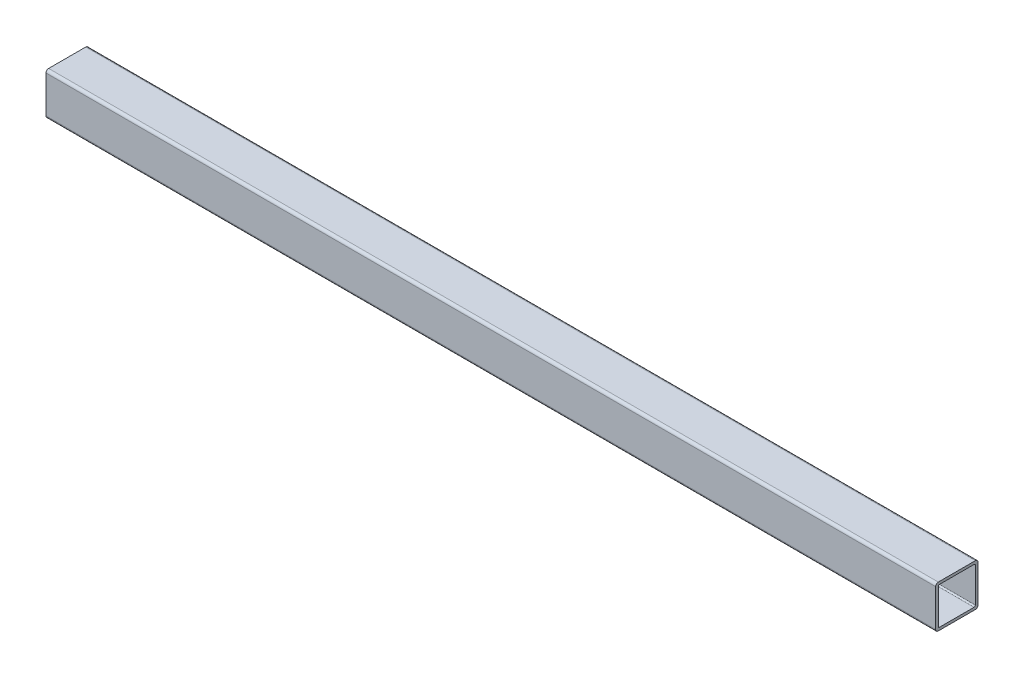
ISO-10303-21;
HEADER;
FILE_DESCRIPTION(('STEP AP214'),'2;1');
FILE_NAME('part.step','',(''),(''),'','','');
FILE_SCHEMA(('AUTOMOTIVE_DESIGN { 1 0 10303 214 1 1 1 1 }'));
ENDSEC;
DATA;
#1=APPLICATION_CONTEXT('core data for automotive mechanical design processes');
#2=APPLICATION_PROTOCOL_DEFINITION('international standard','automotive_design',2000,#1);
#3=PRODUCT_CONTEXT('',#1,'mechanical');
#4=PRODUCT('Part','Part','',(#3));
#5=PRODUCT_RELATED_PRODUCT_CATEGORY('part','',(#4));
#6=PRODUCT_DEFINITION_FORMATION('','',#4);
#7=PRODUCT_DEFINITION_CONTEXT('part definition',#1,'design');
#8=PRODUCT_DEFINITION('design','',#6,#7);
#9=PRODUCT_DEFINITION_SHAPE('','',#8);
#10=(LENGTH_UNIT() NAMED_UNIT(*) SI_UNIT(.MILLI.,.METRE.));
#11=(NAMED_UNIT(*) PLANE_ANGLE_UNIT() SI_UNIT($,.RADIAN.));
#12=(NAMED_UNIT(*) SI_UNIT($,.STERADIAN.) SOLID_ANGLE_UNIT());
#13=UNCERTAINTY_MEASURE_WITH_UNIT(LENGTH_MEASURE(1.E-05),#10,'distance_accuracy_value','');
#14=(GEOMETRIC_REPRESENTATION_CONTEXT(3) GLOBAL_UNCERTAINTY_ASSIGNED_CONTEXT((#13)) GLOBAL_UNIT_ASSIGNED_CONTEXT((#10,
#11,#12)) REPRESENTATION_CONTEXT('',''));
#15=CARTESIAN_POINT('',(0.,0.,0.));
#16=DIRECTION('',(0.,0.,1.));
#17=DIRECTION('',(1.,0.,0.));
#18=AXIS2_PLACEMENT_3D('',#15,#16,#17);
#19=CARTESIAN_POINT('',(533.4,-22.225,22.225));
#20=DIRECTION('',(1.,0.,0.));
#21=DIRECTION('',(0.,0.,-1.));
#22=AXIS2_PLACEMENT_3D('',#19,#20,#21);
#23=PLANE('',#22);
#24=CARTESIAN_POINT('',(533.4,-22.225,22.225));
#25=DIRECTION('',(1.,0.,0.));
#26=DIRECTION('',(0.,0.,-1.));
#27=AXIS2_PLACEMENT_3D('',#24,#25,#26);
#28=CIRCLE('',#27,3.175);
#29=CARTESIAN_POINT('',(533.4,-22.225,25.4));
#30=VERTEX_POINT('',#29);
#31=CARTESIAN_POINT('',(533.4,-25.4,22.225));
#32=VERTEX_POINT('',#31);
#33=EDGE_CURVE('E211',#30,#32,#28,.T.);
#34=ORIENTED_EDGE('',*,*,#33,.T.);
#35=DIRECTION('',(0.,0.,-1.));
#36=VECTOR('',#35,1.);
#37=CARTESIAN_POINT('',(533.4,-25.4,22.225));
#38=LINE('',#37,#36);
#39=CARTESIAN_POINT('',(533.4,-25.4,-22.225));
#40=VERTEX_POINT('',#39);
#41=EDGE_CURVE('E214',#32,#40,#38,.T.);
#42=ORIENTED_EDGE('',*,*,#41,.T.);
#43=CARTESIAN_POINT('',(533.4,-22.225,-22.225));
#44=DIRECTION('',(1.,0.,0.));
#45=DIRECTION('',(0.,0.,-1.));
#46=AXIS2_PLACEMENT_3D('',#43,#44,#45);
#47=CIRCLE('',#46,3.175);
#48=CARTESIAN_POINT('',(533.4,-22.225,-25.4));
#49=VERTEX_POINT('',#48);
#50=EDGE_CURVE('E217',#40,#49,#47,.T.);
#51=ORIENTED_EDGE('',*,*,#50,.T.);
#52=DIRECTION('',(0.,1.,0.));
#53=VECTOR('',#52,1.);
#54=CARTESIAN_POINT('',(533.4,22.225,-25.4));
#55=LINE('',#54,#53);
#56=CARTESIAN_POINT('',(533.4,22.225,-25.4));
#57=VERTEX_POINT('',#56);
#58=EDGE_CURVE('E219',#49,#57,#55,.T.);
#59=ORIENTED_EDGE('',*,*,#58,.T.);
#60=CARTESIAN_POINT('',(533.4,22.225,-22.225));
#61=DIRECTION('',(1.,0.,0.));
#62=DIRECTION('',(0.,0.,1.));
#63=AXIS2_PLACEMENT_3D('',#60,#61,#62);
#64=CIRCLE('',#63,3.175);
#65=CARTESIAN_POINT('',(533.4,25.4,-22.225));
#66=VERTEX_POINT('',#65);
#67=EDGE_CURVE('E221',#57,#66,#64,.T.);
#68=ORIENTED_EDGE('',*,*,#67,.T.);
#69=DIRECTION('',(0.,0.,1.));
#70=VECTOR('',#69,1.);
#71=CARTESIAN_POINT('',(533.4,25.4,22.225));
#72=LINE('',#71,#70);
#73=CARTESIAN_POINT('',(533.4,25.4,22.225));
#74=VERTEX_POINT('',#73);
#75=EDGE_CURVE('E223',#66,#74,#72,.T.);
#76=ORIENTED_EDGE('',*,*,#75,.T.);
#77=CARTESIAN_POINT('',(533.4,22.225,22.225));
#78=DIRECTION('',(1.,0.,0.));
#79=DIRECTION('',(0.,0.,-1.));
#80=AXIS2_PLACEMENT_3D('',#77,#78,#79);
#81=CIRCLE('',#80,3.175);
#82=CARTESIAN_POINT('',(533.4,22.225,25.4));
#83=VERTEX_POINT('',#82);
#84=EDGE_CURVE('E225',#74,#83,#81,.T.);
#85=ORIENTED_EDGE('',*,*,#84,.T.);
#86=DIRECTION('',(0.,-1.,0.));
#87=VECTOR('',#86,1.);
#88=CARTESIAN_POINT('',(533.4,22.225,25.4));
#89=LINE('',#88,#87);
#90=EDGE_CURVE('E227',#83,#30,#89,.T.);
#91=ORIENTED_EDGE('',*,*,#90,.T.);
#92=EDGE_LOOP('',(#34,#42,#51,#59,#68,#76,#85,#91));
#93=FACE_BOUND('',#92,.T.);
#94=DIRECTION('',(0.,-1.,0.));
#95=VECTOR('',#94,1.);
#96=CARTESIAN_POINT('',(533.4,20.6375,22.225));
#97=LINE('',#96,#95);
#98=CARTESIAN_POINT('',(533.4,20.6375,22.225));
#99=VERTEX_POINT('',#98);
#100=CARTESIAN_POINT('',(533.4,-20.6375,22.225));
#101=VERTEX_POINT('',#100);
#102=EDGE_CURVE('E154',#99,#101,#97,.T.);
#103=ORIENTED_EDGE('',*,*,#102,.F.);
#104=CARTESIAN_POINT('',(533.4,20.6375,20.6375));
#105=DIRECTION('',(1.,0.,0.));
#106=DIRECTION('',(0.,0.,-1.));
#107=AXIS2_PLACEMENT_3D('',#104,#105,#106);
#108=CIRCLE('',#107,1.5875);
#109=CARTESIAN_POINT('',(533.4,22.225,20.6375));
#110=VERTEX_POINT('',#109);
#111=EDGE_CURVE('E146',#110,#99,#108,.T.);
#112=ORIENTED_EDGE('',*,*,#111,.F.);
#113=DIRECTION('',(0.,0.,1.));
#114=VECTOR('',#113,1.);
#115=CARTESIAN_POINT('',(533.4,22.225,20.6375));
#116=LINE('',#115,#114);
#117=CARTESIAN_POINT('',(533.4,22.225,-20.6375));
#118=VERTEX_POINT('',#117);
#119=EDGE_CURVE('E179',#118,#110,#116,.T.);
#120=ORIENTED_EDGE('',*,*,#119,.F.);
#121=CARTESIAN_POINT('',(533.4,20.6375,-20.6375));
#122=DIRECTION('',(1.,0.,0.));
#123=DIRECTION('',(0.,0.,1.));
#124=AXIS2_PLACEMENT_3D('',#121,#122,#123);
#125=CIRCLE('',#124,1.5875);
#126=CARTESIAN_POINT('',(533.4,20.6375,-22.225));
#127=VERTEX_POINT('',#126);
#128=EDGE_CURVE('E177',#127,#118,#125,.T.);
#129=ORIENTED_EDGE('',*,*,#128,.F.);
#130=DIRECTION('',(0.,1.,0.));
#131=VECTOR('',#130,1.);
#132=CARTESIAN_POINT('',(533.4,20.6375,-22.225));
#133=LINE('',#132,#131);
#134=CARTESIAN_POINT('',(533.4,-20.6375,-22.225));
#135=VERTEX_POINT('',#134);
#136=EDGE_CURVE('E175',#135,#127,#133,.T.);
#137=ORIENTED_EDGE('',*,*,#136,.F.);
#138=CARTESIAN_POINT('',(533.4,-20.6375,-20.6375));
#139=DIRECTION('',(1.,0.,0.));
#140=DIRECTION('',(0.,0.,-1.));
#141=AXIS2_PLACEMENT_3D('',#138,#139,#140);
#142=CIRCLE('',#141,1.5875);
#143=CARTESIAN_POINT('',(533.4,-22.225,-20.6375));
#144=VERTEX_POINT('',#143);
#145=EDGE_CURVE('E173',#144,#135,#142,.T.);
#146=ORIENTED_EDGE('',*,*,#145,.F.);
#147=DIRECTION('',(0.,0.,-1.));
#148=VECTOR('',#147,1.);
#149=CARTESIAN_POINT('',(533.4,-22.225,20.6375));
#150=LINE('',#149,#148);
#151=CARTESIAN_POINT('',(533.4,-22.225,20.6375));
#152=VERTEX_POINT('',#151);
#153=EDGE_CURVE('E169',#152,#144,#150,.T.);
#154=ORIENTED_EDGE('',*,*,#153,.F.);
#155=CARTESIAN_POINT('',(533.4,-20.6375,20.6375));
#156=DIRECTION('',(1.,0.,0.));
#157=DIRECTION('',(0.,0.,-1.));
#158=AXIS2_PLACEMENT_3D('',#155,#156,#157);
#159=CIRCLE('',#158,1.5875);
#160=EDGE_CURVE('E167',#101,#152,#159,.T.);
#161=ORIENTED_EDGE('',*,*,#160,.F.);
#162=EDGE_LOOP('',(#103,#112,#120,#129,#137,#146,#154,#161));
#163=FACE_BOUND('',#162,.T.);
#164=ADVANCED_FACE('F33',(#93,#163),#23,.T.);
#165=CARTESIAN_POINT('',(-533.4,-22.225,22.225));
#166=DIRECTION('',(1.,0.,0.));
#167=DIRECTION('',(0.,0.,-1.));
#168=AXIS2_PLACEMENT_3D('',#165,#166,#167);
#169=PLANE('',#168);
#170=CARTESIAN_POINT('',(-533.4,-22.225,22.225));
#171=DIRECTION('',(1.,0.,0.));
#172=DIRECTION('',(0.,0.,-1.));
#173=AXIS2_PLACEMENT_3D('',#170,#171,#172);
#174=CIRCLE('',#173,3.175);
#175=CARTESIAN_POINT('',(-533.4,-22.225,25.4));
#176=VERTEX_POINT('',#175);
#177=CARTESIAN_POINT('',(-533.4,-25.4,22.225));
#178=VERTEX_POINT('',#177);
#179=EDGE_CURVE('E162',#176,#178,#174,.T.);
#180=ORIENTED_EDGE('',*,*,#179,.F.);
#181=DIRECTION('',(0.,-1.,0.));
#182=VECTOR('',#181,1.);
#183=CARTESIAN_POINT('',(-533.4,22.225,25.4));
#184=LINE('',#183,#182);
#185=CARTESIAN_POINT('',(-533.4,22.225,25.4));
#186=VERTEX_POINT('',#185);
#187=EDGE_CURVE('E215',#186,#176,#184,.T.);
#188=ORIENTED_EDGE('',*,*,#187,.F.);
#189=CARTESIAN_POINT('',(-533.4,22.225,22.225));
#190=DIRECTION('',(1.,0.,0.));
#191=DIRECTION('',(0.,0.,-1.));
#192=AXIS2_PLACEMENT_3D('',#189,#190,#191);
#193=CIRCLE('',#192,3.175);
#194=CARTESIAN_POINT('',(-533.4,25.4,22.225));
#195=VERTEX_POINT('',#194);
#196=EDGE_CURVE('E242',#195,#186,#193,.T.);
#197=ORIENTED_EDGE('',*,*,#196,.F.);
#198=DIRECTION('',(0.,0.,1.));
#199=VECTOR('',#198,1.);
#200=CARTESIAN_POINT('',(-533.4,25.4,22.225));
#201=LINE('',#200,#199);
#202=CARTESIAN_POINT('',(-533.4,25.4,-22.225));
#203=VERTEX_POINT('',#202);
#204=EDGE_CURVE('E240',#203,#195,#201,.T.);
#205=ORIENTED_EDGE('',*,*,#204,.F.);
#206=CARTESIAN_POINT('',(-533.4,22.225,-22.225));
#207=DIRECTION('',(1.,0.,0.));
#208=DIRECTION('',(0.,0.,1.));
#209=AXIS2_PLACEMENT_3D('',#206,#207,#208);
#210=CIRCLE('',#209,3.175);
#211=CARTESIAN_POINT('',(-533.4,22.225,-25.4));
#212=VERTEX_POINT('',#211);
#213=EDGE_CURVE('E238',#212,#203,#210,.T.);
#214=ORIENTED_EDGE('',*,*,#213,.F.);
#215=DIRECTION('',(0.,1.,0.));
#216=VECTOR('',#215,1.);
#217=CARTESIAN_POINT('',(-533.4,22.225,-25.4));
#218=LINE('',#217,#216);
#219=CARTESIAN_POINT('',(-533.4,-22.225,-25.4));
#220=VERTEX_POINT('',#219);
#221=EDGE_CURVE('E236',#220,#212,#218,.T.);
#222=ORIENTED_EDGE('',*,*,#221,.F.);
#223=CARTESIAN_POINT('',(-533.4,-22.225,-22.225));
#224=DIRECTION('',(1.,0.,0.));
#225=DIRECTION('',(0.,0.,-1.));
#226=AXIS2_PLACEMENT_3D('',#223,#224,#225);
#227=CIRCLE('',#226,3.175);
#228=CARTESIAN_POINT('',(-533.4,-25.4,-22.225));
#229=VERTEX_POINT('',#228);
#230=EDGE_CURVE('E234',#229,#220,#227,.T.);
#231=ORIENTED_EDGE('',*,*,#230,.F.);
#232=DIRECTION('',(0.,0.,-1.));
#233=VECTOR('',#232,1.);
#234=CARTESIAN_POINT('',(-533.4,-25.4,22.225));
#235=LINE('',#234,#233);
#236=EDGE_CURVE('E232',#178,#229,#235,.T.);
#237=ORIENTED_EDGE('',*,*,#236,.F.);
#238=EDGE_LOOP('',(#180,#188,#197,#205,#214,#222,#231,#237));
#239=FACE_BOUND('',#238,.T.);
#240=CARTESIAN_POINT('',(-533.4,20.6375,20.6375));
#241=DIRECTION('',(1.,0.,0.));
#242=DIRECTION('',(0.,0.,-1.));
#243=AXIS2_PLACEMENT_3D('',#240,#241,#242);
#244=CIRCLE('',#243,1.5875);
#245=CARTESIAN_POINT('',(-533.4,22.225,20.6375));
#246=VERTEX_POINT('',#245);
#247=CARTESIAN_POINT('',(-533.4,20.6375,22.225));
#248=VERTEX_POINT('',#247);
#249=EDGE_CURVE('E56',#246,#248,#244,.T.);
#250=ORIENTED_EDGE('',*,*,#249,.T.);
#251=DIRECTION('',(0.,-1.,0.));
#252=VECTOR('',#251,1.);
#253=CARTESIAN_POINT('',(-533.4,20.6375,22.225));
#254=LINE('',#253,#252);
#255=CARTESIAN_POINT('',(-533.4,-20.6375,22.225));
#256=VERTEX_POINT('',#255);
#257=EDGE_CURVE('E161',#248,#256,#254,.T.);
#258=ORIENTED_EDGE('',*,*,#257,.T.);
#259=CARTESIAN_POINT('',(-533.4,-20.6375,20.6375));
#260=DIRECTION('',(1.,0.,0.));
#261=DIRECTION('',(0.,0.,-1.));
#262=AXIS2_PLACEMENT_3D('',#259,#260,#261);
#263=CIRCLE('',#262,1.5875);
#264=CARTESIAN_POINT('',(-533.4,-22.225,20.6375));
#265=VERTEX_POINT('',#264);
#266=EDGE_CURVE('E183',#256,#265,#263,.T.);
#267=ORIENTED_EDGE('',*,*,#266,.T.);
#268=DIRECTION('',(0.,0.,-1.));
#269=VECTOR('',#268,1.);
#270=CARTESIAN_POINT('',(-533.4,-22.225,20.6375));
#271=LINE('',#270,#269);
#272=CARTESIAN_POINT('',(-533.4,-22.225,-20.6375));
#273=VERTEX_POINT('',#272);
#274=EDGE_CURVE('E186',#265,#273,#271,.T.);
#275=ORIENTED_EDGE('',*,*,#274,.T.);
#276=CARTESIAN_POINT('',(-533.4,-20.6375,-20.6375));
#277=DIRECTION('',(1.,0.,0.));
#278=DIRECTION('',(0.,0.,-1.));
#279=AXIS2_PLACEMENT_3D('',#276,#277,#278);
#280=CIRCLE('',#279,1.5875);
#281=CARTESIAN_POINT('',(-533.4,-20.6375,-22.225));
#282=VERTEX_POINT('',#281);
#283=EDGE_CURVE('E189',#273,#282,#280,.T.);
#284=ORIENTED_EDGE('',*,*,#283,.T.);
#285=DIRECTION('',(0.,1.,0.));
#286=VECTOR('',#285,1.);
#287=CARTESIAN_POINT('',(-533.4,20.6375,-22.225));
#288=LINE('',#287,#286);
#289=CARTESIAN_POINT('',(-533.4,20.6375,-22.225));
#290=VERTEX_POINT('',#289);
#291=EDGE_CURVE('E192',#282,#290,#288,.T.);
#292=ORIENTED_EDGE('',*,*,#291,.T.);
#293=CARTESIAN_POINT('',(-533.4,20.6375,-20.6375));
#294=DIRECTION('',(1.,0.,0.));
#295=DIRECTION('',(0.,0.,1.));
#296=AXIS2_PLACEMENT_3D('',#293,#294,#295);
#297=CIRCLE('',#296,1.5875);
#298=CARTESIAN_POINT('',(-533.4,22.225,-20.6375));
#299=VERTEX_POINT('',#298);
#300=EDGE_CURVE('E195',#290,#299,#297,.T.);
#301=ORIENTED_EDGE('',*,*,#300,.T.);
#302=DIRECTION('',(0.,0.,1.));
#303=VECTOR('',#302,1.);
#304=CARTESIAN_POINT('',(-533.4,22.225,20.6375));
#305=LINE('',#304,#303);
#306=EDGE_CURVE('E155',#299,#246,#305,.T.);
#307=ORIENTED_EDGE('',*,*,#306,.T.);
#308=EDGE_LOOP('',(#250,#258,#267,#275,#284,#292,#301,#307));
#309=FACE_BOUND('',#308,.T.);
#310=ADVANCED_FACE('F272',(#239,#309),#169,.F.);
#311=CARTESIAN_POINT('',(533.4,-22.225,22.225));
#312=DIRECTION('',(-1.,0.,0.));
#313=DIRECTION('',(0.,0.,1.));
#314=AXIS2_PLACEMENT_3D('',#311,#312,#313);
#315=CYLINDRICAL_SURFACE('',#314,3.175);
#316=ORIENTED_EDGE('',*,*,#179,.T.);
#317=DIRECTION('',(-1.,0.,0.));
#318=VECTOR('',#317,1.);
#319=CARTESIAN_POINT('',(533.4,-25.4,22.225));
#320=LINE('',#319,#318);
#321=EDGE_CURVE('E11',#32,#178,#320,.T.);
#322=ORIENTED_EDGE('',*,*,#321,.F.);
#323=ORIENTED_EDGE('',*,*,#33,.F.);
#324=DIRECTION('',(-1.,0.,0.));
#325=VECTOR('',#324,1.);
#326=CARTESIAN_POINT('',(533.4,-22.225,25.4));
#327=LINE('',#326,#325);
#328=EDGE_CURVE('E229',#30,#176,#327,.T.);
#329=ORIENTED_EDGE('',*,*,#328,.T.);
#330=EDGE_LOOP('',(#316,#322,#323,#329));
#331=FACE_BOUND('',#330,.T.);
#332=ADVANCED_FACE('F35',(#331),#315,.T.);
#333=CARTESIAN_POINT('',(533.4,-25.4,22.225));
#334=DIRECTION('',(0.,1.,0.));
#335=DIRECTION('',(0.,0.,1.));
#336=AXIS2_PLACEMENT_3D('',#333,#334,#335);
#337=PLANE('',#336);
#338=ORIENTED_EDGE('',*,*,#236,.T.);
#339=DIRECTION('',(-1.,0.,0.));
#340=VECTOR('',#339,1.);
#341=CARTESIAN_POINT('',(533.4,-25.4,-22.225));
#342=LINE('',#341,#340);
#343=EDGE_CURVE('E41',#40,#229,#342,.T.);
#344=ORIENTED_EDGE('',*,*,#343,.F.);
#345=ORIENTED_EDGE('',*,*,#41,.F.);
#346=ORIENTED_EDGE('',*,*,#321,.T.);
#347=EDGE_LOOP('',(#338,#344,#345,#346));
#348=FACE_BOUND('',#347,.T.);
#349=ADVANCED_FACE('F289',(#348),#337,.F.);
#350=CARTESIAN_POINT('',(533.4,-22.225,-22.225));
#351=DIRECTION('',(-1.,0.,0.));
#352=DIRECTION('',(0.,0.,1.));
#353=AXIS2_PLACEMENT_3D('',#350,#351,#352);
#354=CYLINDRICAL_SURFACE('',#353,3.175);
#355=ORIENTED_EDGE('',*,*,#230,.T.);
#356=DIRECTION('',(-1.,0.,0.));
#357=VECTOR('',#356,1.);
#358=CARTESIAN_POINT('',(533.4,-22.225,-25.4));
#359=LINE('',#358,#357);
#360=EDGE_CURVE('E259',#49,#220,#359,.T.);
#361=ORIENTED_EDGE('',*,*,#360,.F.);
#362=ORIENTED_EDGE('',*,*,#50,.F.);
#363=ORIENTED_EDGE('',*,*,#343,.T.);
#364=EDGE_LOOP('',(#355,#361,#362,#363));
#365=FACE_BOUND('',#364,.T.);
#366=ADVANCED_FACE('F266',(#365),#354,.T.);
#367=CARTESIAN_POINT('',(533.4,22.225,-25.4));
#368=DIRECTION('',(0.,0.,1.));
#369=DIRECTION('',(0.,-1.,0.));
#370=AXIS2_PLACEMENT_3D('',#367,#368,#369);
#371=PLANE('',#370);
#372=ORIENTED_EDGE('',*,*,#221,.T.);
#373=DIRECTION('',(-1.,0.,0.));
#374=VECTOR('',#373,1.);
#375=CARTESIAN_POINT('',(533.4,22.225,-25.4));
#376=LINE('',#375,#374);
#377=EDGE_CURVE('E256',#57,#212,#376,.T.);
#378=ORIENTED_EDGE('',*,*,#377,.F.);
#379=ORIENTED_EDGE('',*,*,#58,.F.);
#380=ORIENTED_EDGE('',*,*,#360,.T.);
#381=EDGE_LOOP('',(#372,#378,#379,#380));
#382=FACE_BOUND('',#381,.T.);
#383=ADVANCED_FACE('F278',(#382),#371,.F.);
#384=CARTESIAN_POINT('',(533.4,22.225,-22.225));
#385=DIRECTION('',(-1.,0.,0.));
#386=DIRECTION('',(0.,0.,1.));
#387=AXIS2_PLACEMENT_3D('',#384,#385,#386);
#388=CYLINDRICAL_SURFACE('',#387,3.175);
#389=ORIENTED_EDGE('',*,*,#213,.T.);
#390=DIRECTION('',(-1.,0.,0.));
#391=VECTOR('',#390,1.);
#392=CARTESIAN_POINT('',(533.4,25.4,-22.225));
#393=LINE('',#392,#391);
#394=EDGE_CURVE('E253',#66,#203,#393,.T.);
#395=ORIENTED_EDGE('',*,*,#394,.F.);
#396=ORIENTED_EDGE('',*,*,#67,.F.);
#397=ORIENTED_EDGE('',*,*,#377,.T.);
#398=EDGE_LOOP('',(#389,#395,#396,#397));
#399=FACE_BOUND('',#398,.T.);
#400=ADVANCED_FACE('F282',(#399),#388,.T.);
#401=CARTESIAN_POINT('',(533.4,25.4,22.225));
#402=DIRECTION('',(0.,-1.,0.));
#403=DIRECTION('',(0.,0.,-1.));
#404=AXIS2_PLACEMENT_3D('',#401,#402,#403);
#405=PLANE('',#404);
#406=ORIENTED_EDGE('',*,*,#204,.T.);
#407=DIRECTION('',(-1.,0.,0.));
#408=VECTOR('',#407,1.);
#409=CARTESIAN_POINT('',(533.4,25.4,22.225));
#410=LINE('',#409,#408);
#411=EDGE_CURVE('E250',#74,#195,#410,.T.);
#412=ORIENTED_EDGE('',*,*,#411,.F.);
#413=ORIENTED_EDGE('',*,*,#75,.F.);
#414=ORIENTED_EDGE('',*,*,#394,.T.);
#415=EDGE_LOOP('',(#406,#412,#413,#414));
#416=FACE_BOUND('',#415,.T.);
#417=ADVANCED_FACE('F302',(#416),#405,.F.);
#418=CARTESIAN_POINT('',(533.4,22.225,22.225));
#419=DIRECTION('',(-1.,0.,0.));
#420=DIRECTION('',(0.,0.,1.));
#421=AXIS2_PLACEMENT_3D('',#418,#419,#420);
#422=CYLINDRICAL_SURFACE('',#421,3.175);
#423=ORIENTED_EDGE('',*,*,#196,.T.);
#424=DIRECTION('',(-1.,0.,0.));
#425=VECTOR('',#424,1.);
#426=CARTESIAN_POINT('',(533.4,22.225,25.4));
#427=LINE('',#426,#425);
#428=EDGE_CURVE('E247',#83,#186,#427,.T.);
#429=ORIENTED_EDGE('',*,*,#428,.F.);
#430=ORIENTED_EDGE('',*,*,#84,.F.);
#431=ORIENTED_EDGE('',*,*,#411,.T.);
#432=EDGE_LOOP('',(#423,#429,#430,#431));
#433=FACE_BOUND('',#432,.T.);
#434=ADVANCED_FACE('F300',(#433),#422,.T.);
#435=CARTESIAN_POINT('',(533.4,22.225,25.4));
#436=DIRECTION('',(0.,0.,-1.));
#437=DIRECTION('',(0.,1.,0.));
#438=AXIS2_PLACEMENT_3D('',#435,#436,#437);
#439=PLANE('',#438);
#440=ORIENTED_EDGE('',*,*,#187,.T.);
#441=ORIENTED_EDGE('',*,*,#328,.F.);
#442=ORIENTED_EDGE('',*,*,#90,.F.);
#443=ORIENTED_EDGE('',*,*,#428,.T.);
#444=EDGE_LOOP('',(#440,#441,#442,#443));
#445=FACE_BOUND('',#444,.T.);
#446=ADVANCED_FACE('F295',(#445),#439,.F.);
#447=CARTESIAN_POINT('',(533.4,20.6375,20.6375));
#448=DIRECTION('',(-1.,0.,0.));
#449=DIRECTION('',(0.,0.,1.));
#450=AXIS2_PLACEMENT_3D('',#447,#448,#449);
#451=CYLINDRICAL_SURFACE('',#450,1.5875);
#452=ORIENTED_EDGE('',*,*,#249,.F.);
#453=DIRECTION('',(-1.,0.,0.));
#454=VECTOR('',#453,1.);
#455=CARTESIAN_POINT('',(533.4,22.225,20.6375));
#456=LINE('',#455,#454);
#457=EDGE_CURVE('E150',#110,#246,#456,.T.);
#458=ORIENTED_EDGE('',*,*,#457,.F.);
#459=ORIENTED_EDGE('',*,*,#111,.T.);
#460=DIRECTION('',(-1.,0.,0.));
#461=VECTOR('',#460,1.);
#462=CARTESIAN_POINT('',(533.4,20.6375,22.225));
#463=LINE('',#462,#461);
#464=EDGE_CURVE('E149',#99,#248,#463,.T.);
#465=ORIENTED_EDGE('',*,*,#464,.T.);
#466=EDGE_LOOP('',(#452,#458,#459,#465));
#467=FACE_BOUND('',#466,.T.);
#468=ADVANCED_FACE('F148',(#467),#451,.F.);
#469=CARTESIAN_POINT('',(533.4,20.6375,22.225));
#470=DIRECTION('',(0.,0.,-1.));
#471=DIRECTION('',(-1.,0.,0.));
#472=AXIS2_PLACEMENT_3D('',#469,#470,#471);
#473=PLANE('',#472);
#474=ORIENTED_EDGE('',*,*,#257,.F.);
#475=ORIENTED_EDGE('',*,*,#464,.F.);
#476=ORIENTED_EDGE('',*,*,#102,.T.);
#477=DIRECTION('',(-1.,0.,0.));
#478=VECTOR('',#477,1.);
#479=CARTESIAN_POINT('',(533.4,-20.6375,22.225));
#480=LINE('',#479,#478);
#481=EDGE_CURVE('E163',#101,#256,#480,.T.);
#482=ORIENTED_EDGE('',*,*,#481,.T.);
#483=EDGE_LOOP('',(#474,#475,#476,#482));
#484=FACE_BOUND('',#483,.T.);
#485=ADVANCED_FACE('F158',(#484),#473,.T.);
#486=CARTESIAN_POINT('',(533.4,-20.6375,20.6375));
#487=DIRECTION('',(-1.,0.,0.));
#488=DIRECTION('',(0.,0.,1.));
#489=AXIS2_PLACEMENT_3D('',#486,#487,#488);
#490=CYLINDRICAL_SURFACE('',#489,1.5875);
#491=ORIENTED_EDGE('',*,*,#266,.F.);
#492=ORIENTED_EDGE('',*,*,#481,.F.);
#493=ORIENTED_EDGE('',*,*,#160,.T.);
#494=DIRECTION('',(-1.,0.,0.));
#495=VECTOR('',#494,1.);
#496=CARTESIAN_POINT('',(533.4,-22.225,20.6375));
#497=LINE('',#496,#495);
#498=EDGE_CURVE('E208',#152,#265,#497,.T.);
#499=ORIENTED_EDGE('',*,*,#498,.T.);
#500=EDGE_LOOP('',(#491,#492,#493,#499));
#501=FACE_BOUND('',#500,.T.);
#502=ADVANCED_FACE('F327',(#501),#490,.F.);
#503=CARTESIAN_POINT('',(533.4,-22.225,20.6375));
#504=DIRECTION('',(0.,1.,0.));
#505=DIRECTION('',(0.,0.,1.));
#506=AXIS2_PLACEMENT_3D('',#503,#504,#505);
#507=PLANE('',#506);
#508=ORIENTED_EDGE('',*,*,#274,.F.);
#509=ORIENTED_EDGE('',*,*,#498,.F.);
#510=ORIENTED_EDGE('',*,*,#153,.T.);
#511=DIRECTION('',(-1.,0.,0.));
#512=VECTOR('',#511,1.);
#513=CARTESIAN_POINT('',(533.4,-22.225,-20.6375));
#514=LINE('',#513,#512);
#515=EDGE_CURVE('E206',#144,#273,#514,.T.);
#516=ORIENTED_EDGE('',*,*,#515,.T.);
#517=EDGE_LOOP('',(#508,#509,#510,#516));
#518=FACE_BOUND('',#517,.T.);
#519=ADVANCED_FACE('F331',(#518),#507,.T.);
#520=CARTESIAN_POINT('',(533.4,-20.6375,-20.6375));
#521=DIRECTION('',(-1.,0.,0.));
#522=DIRECTION('',(0.,0.,1.));
#523=AXIS2_PLACEMENT_3D('',#520,#521,#522);
#524=CYLINDRICAL_SURFACE('',#523,1.5875);
#525=ORIENTED_EDGE('',*,*,#283,.F.);
#526=ORIENTED_EDGE('',*,*,#515,.F.);
#527=ORIENTED_EDGE('',*,*,#145,.T.);
#528=DIRECTION('',(-1.,0.,0.));
#529=VECTOR('',#528,1.);
#530=CARTESIAN_POINT('',(533.4,-20.6375,-22.225));
#531=LINE('',#530,#529);
#532=EDGE_CURVE('E204',#135,#282,#531,.T.);
#533=ORIENTED_EDGE('',*,*,#532,.T.);
#534=EDGE_LOOP('',(#525,#526,#527,#533));
#535=FACE_BOUND('',#534,.T.);
#536=ADVANCED_FACE('F337',(#535),#524,.F.);
#537=CARTESIAN_POINT('',(533.4,20.6375,-22.225));
#538=DIRECTION('',(0.,0.,1.));
#539=DIRECTION('',(0.,-1.,0.));
#540=AXIS2_PLACEMENT_3D('',#537,#538,#539);
#541=PLANE('',#540);
#542=ORIENTED_EDGE('',*,*,#291,.F.);
#543=ORIENTED_EDGE('',*,*,#532,.F.);
#544=ORIENTED_EDGE('',*,*,#136,.T.);
#545=DIRECTION('',(-1.,0.,0.));
#546=VECTOR('',#545,1.);
#547=CARTESIAN_POINT('',(533.4,20.6375,-22.225));
#548=LINE('',#547,#546);
#549=EDGE_CURVE('E202',#127,#290,#548,.T.);
#550=ORIENTED_EDGE('',*,*,#549,.T.);
#551=EDGE_LOOP('',(#542,#543,#544,#550));
#552=FACE_BOUND('',#551,.T.);
#553=ADVANCED_FACE('F341',(#552),#541,.T.);
#554=CARTESIAN_POINT('',(533.4,20.6375,-20.6375));
#555=DIRECTION('',(-1.,0.,0.));
#556=DIRECTION('',(0.,0.,1.));
#557=AXIS2_PLACEMENT_3D('',#554,#555,#556);
#558=CYLINDRICAL_SURFACE('',#557,1.5875);
#559=ORIENTED_EDGE('',*,*,#300,.F.);
#560=ORIENTED_EDGE('',*,*,#549,.F.);
#561=ORIENTED_EDGE('',*,*,#128,.T.);
#562=DIRECTION('',(-1.,0.,0.));
#563=VECTOR('',#562,1.);
#564=CARTESIAN_POINT('',(533.4,22.225,-20.6375));
#565=LINE('',#564,#563);
#566=EDGE_CURVE('E48',#118,#299,#565,.T.);
#567=ORIENTED_EDGE('',*,*,#566,.T.);
#568=EDGE_LOOP('',(#559,#560,#561,#567));
#569=FACE_BOUND('',#568,.T.);
#570=ADVANCED_FACE('F345',(#569),#558,.F.);
#571=CARTESIAN_POINT('',(533.4,22.225,20.6375));
#572=DIRECTION('',(0.,-1.,0.));
#573=DIRECTION('',(0.,0.,-1.));
#574=AXIS2_PLACEMENT_3D('',#571,#572,#573);
#575=PLANE('',#574);
#576=ORIENTED_EDGE('',*,*,#306,.F.);
#577=ORIENTED_EDGE('',*,*,#566,.F.);
#578=ORIENTED_EDGE('',*,*,#119,.T.);
#579=ORIENTED_EDGE('',*,*,#457,.T.);
#580=EDGE_LOOP('',(#576,#577,#578,#579));
#581=FACE_BOUND('',#580,.T.);
#582=ADVANCED_FACE('F349',(#581),#575,.T.);
#583=CLOSED_SHELL('',(#164,#310,#332,#349,#366,#383,#400,#417,#434,#446,#468,#485,#502,#519,
#536,#553,#570,#582));
#584=MANIFOLD_SOLID_BREP('B2',#583);
#585=ADVANCED_BREP_SHAPE_REPRESENTATION('',(#18,#584),#14);
#586=SHAPE_DEFINITION_REPRESENTATION(#9,#585);
ENDSEC;
END-ISO-10303-21;
